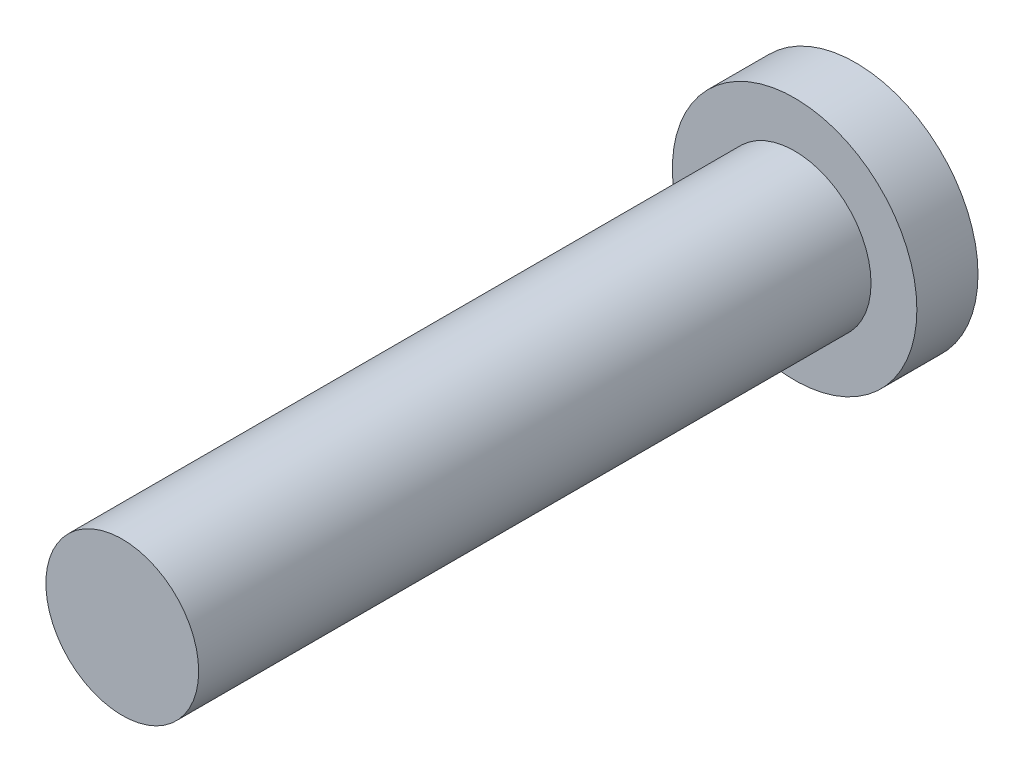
from build123d import *

# Parameters (mm, degrees)
ESQUISSE1_R          = 2
BASE_EXTRUSION_DEPTH = 1
ESQUISSE2_R          = 1.25
BOSS_EXTRU_1_DEPTH   = 11


with BuildPart() as part:
    # Esquisse1 → Base-Extrusion (new body)
    with BuildSketch(Plane.XY):
        Circle(ESQUISSE1_R)
    extrude(amount=BASE_EXTRUSION_DEPTH)

    # Esquisse2 → Boss.-Extru.1 (add)
    with BuildSketch(Plane.XY.offset(1)):
        Circle(ESQUISSE2_R)
    extrude(amount=BOSS_EXTRU_1_DEPTH)


solid = part.part
